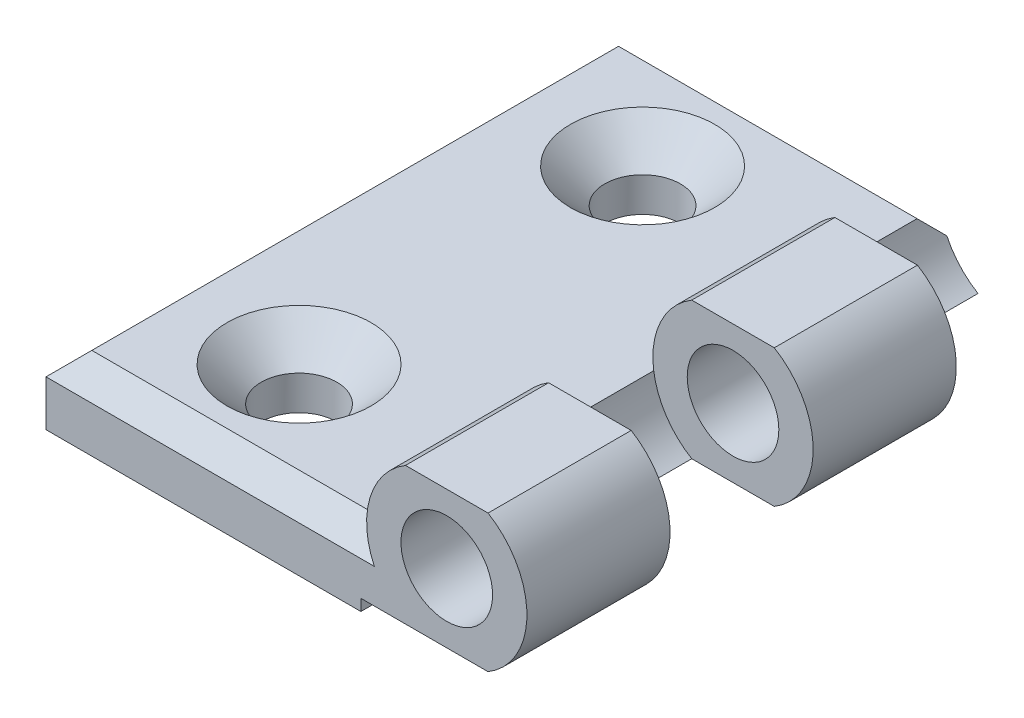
from build123d import *

# Parameters (mm, degrees)
IZIM1_R                                     = 4
Y_KSEKLIK_EKSTR_ZYON1_DEPTH                 = 25
M6_D_Z_HAV_A_BA_L_VIDA_IN_HAV_A1_AT_2_COUNT = 2
M6_D_Z_HAV_A_BA_L_VIDA_IN_HAV_A1_AT_2_PITCH = 30
PAH1_SIZE                                   = 2
IZIM5_R                                     = 7
KES_EKSTR_ZYON1_DEPTH                       = 12.5
KES_EKSTR_ZYON2_START                       = -12.5
IZIM7_R                                     = 7
KES_EKSTR_ZYON2_DEPTH                       = 12.5


with BuildPart() as part:
    # izim1 → Y_kseklik-Ekstr_zyon1 (new, symmetric)
    with BuildSketch(Plane.XY):
        with BuildLine():
            Line((-7.5, -7), (-7.5, -6))
            Line((-7.5, -6), (3.605551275, -6))
            ThreePointArc((3.605551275, -6), (7, 0), (3.605551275, 6))
            Line((3.605551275, 6), (-3.605551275, 6))
            ThreePointArc((-3.605551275, 6), (-6.323764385, 3.001666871), (-6.92820323, -1))
            Line((-6.92820323, -1), (-35, -1))
            Line((-35, -1), (-35, -7))
            Line((-35, -7), (-7.5, -7))
        make_face()
        Circle(IZIM1_R, mode=Mode.SUBTRACT)
    extrude(amount=Y_KSEKLIK_EKSTR_ZYON1_DEPTH, both=True)

    # izim4 → M6 D_z Hav_a Ba_l_ Vida _in Hav_a1 (revolve, cut)
    with BuildSketch(Plane(origin=(-22.9, -1, 15), x_dir=(0, 0, 1), z_dir=(1, 0, 0))):
        Polygon((0, 0), (0, 6), (3.3, 6), (3.3, 3), (6.3, 0), align=None)
    m6_d_z_hav_a_ba_l_vida_in_hav_a1 = revolve(axis=Axis((-22.9, 5.35, 15), (0, -1, 0)), mode=Mode.SUBTRACT)

    # M6 D_z Hav_a Ba_l_ Vida _in Hav_a1 at 2: M6 D_z Hav_a Ba_l_ Vida _in Hav_a1 ×2
    with Locations(*[(0, 0, -i * M6_D_Z_HAV_A_BA_L_VIDA_IN_HAV_A1_AT_2_PITCH) for i in range(1, M6_D_Z_HAV_A_BA_L_VIDA_IN_HAV_A1_AT_2_COUNT)]):
        add(m6_d_z_hav_a_ba_l_vida_in_hav_a1, mode=Mode.SUBTRACT)

    # Pah1
    pah1_edges = [part.edges().sort_by_distance(p)[0] for p in [
        (-35, -1, 0),
        (-20.964101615, -1, 25),
        (-20.964101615, -1, -25),
    ]]
    chamfer(pah1_edges, length=PAH1_SIZE)

    # izim5 → Kes-Ekstr_zyon1 (cut)
    with BuildSketch(Plane.XY.offset(12.5)):
        Circle(IZIM5_R)
    extrude(amount=-KES_EKSTR_ZYON1_DEPTH, mode=Mode.SUBTRACT)

    # izim7 → Kes-Ekstr_zyon2 (cut)
    with BuildSketch(Plane(origin=(0, 0, -25), x_dir=(-1, 0, 0), z_dir=(0, 0, -1)).offset(KES_EKSTR_ZYON2_START)):
        Circle(IZIM7_R)
    extrude(amount=KES_EKSTR_ZYON2_DEPTH, mode=Mode.SUBTRACT)


solid = part.part
